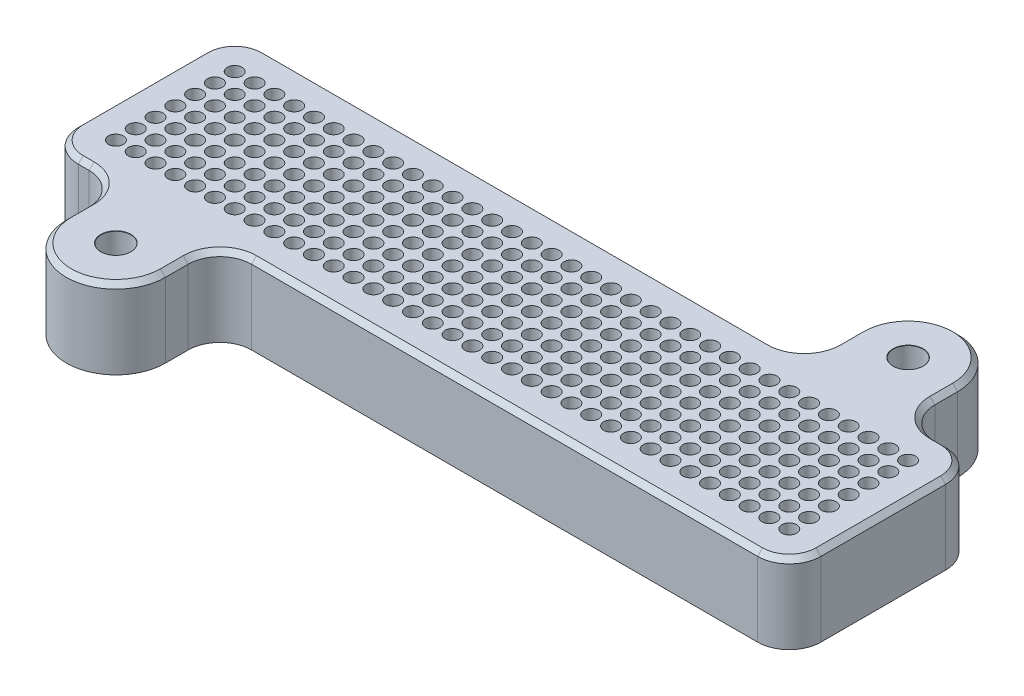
from build123d import *

# Parameters (mm, degrees)
SKETCH2_R                       = 0.75
BOSS_EXTRUDE1_DEPTH             = 8
FILLET7_R                       = 3.2004
F_3_0MM_DOWEL_HOLE1_D           = 3
F_3_0MM_DOWEL_HOLE1_DEPTH       = 10
F_3_0MM_DOWEL_HOLE1_CSINK_D     = 3.05
F_3_0MM_DOWEL_HOLE1_CSINK_ANGLE = 90
F_3_0MM_DOWEL_HOLE1_TIP         = 0.901290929
CHAMFER1_SIZE                   = 0.5


with BuildPart() as part:
    # Sketch2 → Boss-Extrude1 (new body)
    with BuildSketch(Plane(origin=(0, 0, 0), x_dir=(1, 0, 0), z_dir=(0, 1, 0))):
        with BuildLine():
            Line((-37.500004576, 9.5), (20, 9.5))
            Line((20, 9.5), (20, 15))
            ThreePointArc((20, 15), (25, 20), (30, 15))
            Line((30, 15), (30, 9.5))
            Line((30, 9.5), (37.500004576, 9.5))
            Line((37.500004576, 9.5), (37.500004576, -9.5))
            Line((37.500004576, -9.5), (-20, -9.5))
            Line((-20, -9.5), (-20, -15))
            ThreePointArc((-20, -15), (-25, -20), (-30, -15))
            Line((-30, -15), (-30, -9.5))
            Line((-30, -9.5), (-37.500004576, -9.5))
            Line((-37.500004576, -9.5), (-37.500004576, 9.5))
        make_face()
        with Locations(Location((0, 0, 0), (0, 0, 270))):
            Circle(SKETCH2_R, mode=Mode.SUBTRACT)
        with Locations(Location((2, 0, 0), (0, 0, 270))):
            Circle(SKETCH2_R, mode=Mode.SUBTRACT)
        with Locations(Location((4, 0, 0), (0, 0, 270))):
            Circle(SKETCH2_R, mode=Mode.SUBTRACT)
        with Locations(Location((6, 0, 0), (0, 0, 270))):
            Circle(SKETCH2_R, mode=Mode.SUBTRACT)
        with Locations(Location((8, 0, 0), (0, 0, 270))):
            Circle(SKETCH2_R, mode=Mode.SUBTRACT)
        with Locations(Location((10, 0, 0), (0, 0, 270))):
            Circle(SKETCH2_R, mode=Mode.SUBTRACT)
        with Locations(Location((12, 0, 0), (0, 0, 270))):
            Circle(SKETCH2_R, mode=Mode.SUBTRACT)
        with Locations(Location((14, 0, 0), (0, 0, 270))):
            Circle(SKETCH2_R, mode=Mode.SUBTRACT)
        with Locations(Location((16, 0, 0), (0, 0, 270))):
            Circle(SKETCH2_R, mode=Mode.SUBTRACT)
        with Locations(Location((18, 0, 0), (0, 0, 270))):
            Circle(SKETCH2_R, mode=Mode.SUBTRACT)
        with Locations(Location((20, 0, 0), (0, 0, 270))):
            Circle(SKETCH2_R, mode=Mode.SUBTRACT)
        with Locations(Location((22, 0, 0), (0, 0, 270))):
            Circle(SKETCH2_R, mode=Mode.SUBTRACT)
        with Locations(Location((24, 0, 0), (0, 0, 270))):
            Circle(SKETCH2_R, mode=Mode.SUBTRACT)
        with Locations(Location((26, 0, 0), (0, 0, 270))):
            Circle(SKETCH2_R, mode=Mode.SUBTRACT)
        with Locations(Location((28, 0, 0), (0, 0, 270))):
            Circle(SKETCH2_R, mode=Mode.SUBTRACT)
        with Locations(Location((30, 0, 0), (0, 0, 270))):
            Circle(SKETCH2_R, mode=Mode.SUBTRACT)
        with Locations(Location((32, 0, 0), (0, 0, 270))):
            Circle(SKETCH2_R, mode=Mode.SUBTRACT)
        with Locations(Location((34, 0, 0), (0, 0, 270))):
            Circle(SKETCH2_R, mode=Mode.SUBTRACT)
        with Locations(Location((2, 2, 0), (0, 0, 270))):
            Circle(SKETCH2_R, mode=Mode.SUBTRACT)
        with Locations(Location((4, 2, 0), (0, 0, 270))):
            Circle(SKETCH2_R, mode=Mode.SUBTRACT)
        with Locations(Location((6, 2, 0), (0, 0, 270))):
            Circle(SKETCH2_R, mode=Mode.SUBTRACT)
        with Locations(Location((8, 2, 0), (0, 0, 270))):
            Circle(SKETCH2_R, mode=Mode.SUBTRACT)
        with Locations(Location((10, 2, 0), (0, 0, 270))):
            Circle(SKETCH2_R, mode=Mode.SUBTRACT)
        with Locations(Location((12, 2, 0), (0, 0, 270))):
            Circle(SKETCH2_R, mode=Mode.SUBTRACT)
        with Locations(Location((14, 2, 0), (0, 0, 270))):
            Circle(SKETCH2_R, mode=Mode.SUBTRACT)
        with Locations(Location((16, 2, 0), (0, 0, 270))):
            Circle(SKETCH2_R, mode=Mode.SUBTRACT)
        with Locations(Location((18, 2, 0), (0, 0, 270))):
            Circle(SKETCH2_R, mode=Mode.SUBTRACT)
        with Locations(Location((20, 2, 0), (0, 0, 270))):
            Circle(SKETCH2_R, mode=Mode.SUBTRACT)
        with Locations(Location((22, 2, 0), (0, 0, 270))):
            Circle(SKETCH2_R, mode=Mode.SUBTRACT)
        with Locations(Location((24, 2, 0), (0, 0, 270))):
            Circle(SKETCH2_R, mode=Mode.SUBTRACT)
        with Locations(Location((26, 2, 0), (0, 0, 270))):
            Circle(SKETCH2_R, mode=Mode.SUBTRACT)
        with Locations(Location((28, 2, 0), (0, 0, 270))):
            Circle(SKETCH2_R, mode=Mode.SUBTRACT)
        with Locations(Location((30, 2, 0), (0, 0, 270))):
            Circle(SKETCH2_R, mode=Mode.SUBTRACT)
        with Locations(Location((32, 2, 0), (0, 0, 270))):
            Circle(SKETCH2_R, mode=Mode.SUBTRACT)
        with Locations(Location((34, 2, 0), (0, 0, 270))):
            Circle(SKETCH2_R, mode=Mode.SUBTRACT)
        with Locations(Location((2, 4, 0), (0, 0, 270))):
            Circle(SKETCH2_R, mode=Mode.SUBTRACT)
        with Locations(Location((4, 4, 0), (0, 0, 270))):
            Circle(SKETCH2_R, mode=Mode.SUBTRACT)
        with Locations(Location((6, 4, 0), (0, 0, 270))):
            Circle(SKETCH2_R, mode=Mode.SUBTRACT)
        with Locations(Location((8, 4, 0), (0, 0, 270))):
            Circle(SKETCH2_R, mode=Mode.SUBTRACT)
        with Locations(Location((10, 4, 0), (0, 0, 270))):
            Circle(SKETCH2_R, mode=Mode.SUBTRACT)
        with Locations(Location((12, 4, 0), (0, 0, 270))):
            Circle(SKETCH2_R, mode=Mode.SUBTRACT)
        with Locations(Location((14, 4, 0), (0, 0, 270))):
            Circle(SKETCH2_R, mode=Mode.SUBTRACT)
        with Locations(Location((16, 4, 0), (0, 0, 270))):
            Circle(SKETCH2_R, mode=Mode.SUBTRACT)
        with Locations(Location((18, 4, 0), (0, 0, 270))):
            Circle(SKETCH2_R, mode=Mode.SUBTRACT)
        with Locations(Location((20, 4, 0), (0, 0, 270))):
            Circle(SKETCH2_R, mode=Mode.SUBTRACT)
        with Locations(Location((22, 4, 0), (0, 0, 270))):
            Circle(SKETCH2_R, mode=Mode.SUBTRACT)
        with Locations(Location((24, 4, 0), (0, 0, 270))):
            Circle(SKETCH2_R, mode=Mode.SUBTRACT)
        with Locations(Location((26, 4, 0), (0, 0, 270))):
            Circle(SKETCH2_R, mode=Mode.SUBTRACT)
        with Locations(Location((28, 4, 0), (0, 0, 270))):
            Circle(SKETCH2_R, mode=Mode.SUBTRACT)
        with Locations(Location((30, 4, 0), (0, 0, 270))):
            Circle(SKETCH2_R, mode=Mode.SUBTRACT)
        with Locations(Location((32, 4, 0), (0, 0, 270))):
            Circle(SKETCH2_R, mode=Mode.SUBTRACT)
        with Locations(Location((34, 4, 0), (0, 0, 270))):
            Circle(SKETCH2_R, mode=Mode.SUBTRACT)
        with Locations(Location((2, 6, 0), (0, 0, 270))):
            Circle(SKETCH2_R, mode=Mode.SUBTRACT)
        with Locations(Location((4, 6, 0), (0, 0, 270))):
            Circle(SKETCH2_R, mode=Mode.SUBTRACT)
        with Locations(Location((6, 6, 0), (0, 0, 270))):
            Circle(SKETCH2_R, mode=Mode.SUBTRACT)
        with Locations(Location((8, 6, 0), (0, 0, 270))):
            Circle(SKETCH2_R, mode=Mode.SUBTRACT)
        with Locations(Location((10, 6, 0), (0, 0, 270))):
            Circle(SKETCH2_R, mode=Mode.SUBTRACT)
        with Locations(Location((12, 6, 0), (0, 0, 270))):
            Circle(SKETCH2_R, mode=Mode.SUBTRACT)
        with Locations(Location((14, 6, 0), (0, 0, 270))):
            Circle(SKETCH2_R, mode=Mode.SUBTRACT)
        with Locations(Location((16, 6, 0), (0, 0, 270))):
            Circle(SKETCH2_R, mode=Mode.SUBTRACT)
        with Locations(Location((18, 6, 0), (0, 0, 270))):
            Circle(SKETCH2_R, mode=Mode.SUBTRACT)
        with Locations(Location((20, 6, 0), (0, 0, 270))):
            Circle(SKETCH2_R, mode=Mode.SUBTRACT)
        with Locations(Location((22, 6, 0), (0, 0, 270))):
            Circle(SKETCH2_R, mode=Mode.SUBTRACT)
        with Locations(Location((24, 6, 0), (0, 0, 270))):
            Circle(SKETCH2_R, mode=Mode.SUBTRACT)
        with Locations(Location((26, 6, 0), (0, 0, 270))):
            Circle(SKETCH2_R, mode=Mode.SUBTRACT)
        with Locations(Location((28, 6, 0), (0, 0, 270))):
            Circle(SKETCH2_R, mode=Mode.SUBTRACT)
        with Locations(Location((30, 6, 0), (0, 0, 270))):
            Circle(SKETCH2_R, mode=Mode.SUBTRACT)
        with Locations(Location((32, 6, 0), (0, 0, 270))):
            Circle(SKETCH2_R, mode=Mode.SUBTRACT)
        with Locations(Location((34, 6, 0), (0, 0, 270))):
            Circle(SKETCH2_R, mode=Mode.SUBTRACT)
        with Locations(Location((0, 2, 0), (0, 0, 270))):
            Circle(SKETCH2_R, mode=Mode.SUBTRACT)
        with Locations(Location((0, 4, 0), (0, 0, 270))):
            Circle(SKETCH2_R, mode=Mode.SUBTRACT)
        with Locations(Location((0, 6, 0), (0, 0, 270))):
            Circle(SKETCH2_R, mode=Mode.SUBTRACT)
        with Locations(Location((-2, 0, 0), (0, 0, 270))):
            Circle(SKETCH2_R, mode=Mode.SUBTRACT)
        with Locations(Location((-2, 2, 0), (0, 0, 270))):
            Circle(SKETCH2_R, mode=Mode.SUBTRACT)
        with Locations(Location((-2, 4, 0), (0, 0, 270))):
            Circle(SKETCH2_R, mode=Mode.SUBTRACT)
        with Locations(Location((-2, 6, 0), (0, 0, 270))):
            Circle(SKETCH2_R, mode=Mode.SUBTRACT)
        with Locations(Location((-4, 0, 0), (0, 0, 270))):
            Circle(SKETCH2_R, mode=Mode.SUBTRACT)
        with Locations(Location((-4, 2, 0), (0, 0, 270))):
            Circle(SKETCH2_R, mode=Mode.SUBTRACT)
        with Locations(Location((-4, 4, 0), (0, 0, 270))):
            Circle(SKETCH2_R, mode=Mode.SUBTRACT)
        with Locations(Location((-4, 6, 0), (0, 0, 270))):
            Circle(SKETCH2_R, mode=Mode.SUBTRACT)
        with Locations(Location((-6, 0, 0), (0, 0, 270))):
            Circle(SKETCH2_R, mode=Mode.SUBTRACT)
        with Locations(Location((-6, 2, 0), (0, 0, 270))):
            Circle(SKETCH2_R, mode=Mode.SUBTRACT)
        with Locations(Location((-6, 4, 0), (0, 0, 270))):
            Circle(SKETCH2_R, mode=Mode.SUBTRACT)
        with Locations(Location((-6, 6, 0), (0, 0, 270))):
            Circle(SKETCH2_R, mode=Mode.SUBTRACT)
        with Locations(Location((-8, 0, 0), (0, 0, 270))):
            Circle(SKETCH2_R, mode=Mode.SUBTRACT)
        with Locations(Location((-8, 2, 0), (0, 0, 270))):
            Circle(SKETCH2_R, mode=Mode.SUBTRACT)
        with Locations(Location((-8, 4, 0), (0, 0, 270))):
            Circle(SKETCH2_R, mode=Mode.SUBTRACT)
        with Locations(Location((-8, 6, 0), (0, 0, 270))):
            Circle(SKETCH2_R, mode=Mode.SUBTRACT)
        with Locations(Location((-10, 0, 0), (0, 0, 270))):
            Circle(SKETCH2_R, mode=Mode.SUBTRACT)
        with Locations(Location((-10, 2, 0), (0, 0, 270))):
            Circle(SKETCH2_R, mode=Mode.SUBTRACT)
        with Locations(Location((-10, 4, 0), (0, 0, 270))):
            Circle(SKETCH2_R, mode=Mode.SUBTRACT)
        with Locations(Location((-10, 6, 0), (0, 0, 270))):
            Circle(SKETCH2_R, mode=Mode.SUBTRACT)
        with Locations(Location((-12, 0, 0), (0, 0, 270))):
            Circle(SKETCH2_R, mode=Mode.SUBTRACT)
        with Locations(Location((-12, 2, 0), (0, 0, 270))):
            Circle(SKETCH2_R, mode=Mode.SUBTRACT)
        with Locations(Location((-12, 4, 0), (0, 0, 270))):
            Circle(SKETCH2_R, mode=Mode.SUBTRACT)
        with Locations(Location((-12, 6, 0), (0, 0, 270))):
            Circle(SKETCH2_R, mode=Mode.SUBTRACT)
        with Locations(Location((-14, 0, 0), (0, 0, 270))):
            Circle(SKETCH2_R, mode=Mode.SUBTRACT)
        with Locations(Location((-14, 2, 0), (0, 0, 270))):
            Circle(SKETCH2_R, mode=Mode.SUBTRACT)
        with Locations(Location((-14, 4, 0), (0, 0, 270))):
            Circle(SKETCH2_R, mode=Mode.SUBTRACT)
        with Locations(Location((-14, 6, 0), (0, 0, 270))):
            Circle(SKETCH2_R, mode=Mode.SUBTRACT)
        with Locations(Location((-16, 0, 0), (0, 0, 270))):
            Circle(SKETCH2_R, mode=Mode.SUBTRACT)
        with Locations(Location((-16, 2, 0), (0, 0, 270))):
            Circle(SKETCH2_R, mode=Mode.SUBTRACT)
        with Locations(Location((-16, 4, 0), (0, 0, 270))):
            Circle(SKETCH2_R, mode=Mode.SUBTRACT)
        with Locations(Location((-16, 6, 0), (0, 0, 270))):
            Circle(SKETCH2_R, mode=Mode.SUBTRACT)
        with Locations(Location((-18, 0, 0), (0, 0, 270))):
            Circle(SKETCH2_R, mode=Mode.SUBTRACT)
        with Locations(Location((-18, 2, 0), (0, 0, 270))):
            Circle(SKETCH2_R, mode=Mode.SUBTRACT)
        with Locations(Location((-18, 4, 0), (0, 0, 270))):
            Circle(SKETCH2_R, mode=Mode.SUBTRACT)
        with Locations(Location((-18, 6, 0), (0, 0, 270))):
            Circle(SKETCH2_R, mode=Mode.SUBTRACT)
        with Locations(Location((-20, 0, 0), (0, 0, 270))):
            Circle(SKETCH2_R, mode=Mode.SUBTRACT)
        with Locations(Location((-20, 2, 0), (0, 0, 270))):
            Circle(SKETCH2_R, mode=Mode.SUBTRACT)
        with Locations(Location((-20, 4, 0), (0, 0, 270))):
            Circle(SKETCH2_R, mode=Mode.SUBTRACT)
        with Locations(Location((-20, 6, 0), (0, 0, 270))):
            Circle(SKETCH2_R, mode=Mode.SUBTRACT)
        with Locations(Location((-22, 0, 0), (0, 0, 270))):
            Circle(SKETCH2_R, mode=Mode.SUBTRACT)
        with Locations(Location((-22, 2, 0), (0, 0, 270))):
            Circle(SKETCH2_R, mode=Mode.SUBTRACT)
        with Locations(Location((-22, 4, 0), (0, 0, 270))):
            Circle(SKETCH2_R, mode=Mode.SUBTRACT)
        with Locations(Location((-22, 6, 0), (0, 0, 270))):
            Circle(SKETCH2_R, mode=Mode.SUBTRACT)
        with Locations(Location((-24, 0, 0), (0, 0, 270))):
            Circle(SKETCH2_R, mode=Mode.SUBTRACT)
        with Locations(Location((-24, 2, 0), (0, 0, 270))):
            Circle(SKETCH2_R, mode=Mode.SUBTRACT)
        with Locations(Location((-24, 4, 0), (0, 0, 270))):
            Circle(SKETCH2_R, mode=Mode.SUBTRACT)
        with Locations(Location((-24, 6, 0), (0, 0, 270))):
            Circle(SKETCH2_R, mode=Mode.SUBTRACT)
        with Locations(Location((-26, 0, 0), (0, 0, 270))):
            Circle(SKETCH2_R, mode=Mode.SUBTRACT)
        with Locations(Location((-26, 2, 0), (0, 0, 270))):
            Circle(SKETCH2_R, mode=Mode.SUBTRACT)
        with Locations(Location((-26, 4, 0), (0, 0, 270))):
            Circle(SKETCH2_R, mode=Mode.SUBTRACT)
        with Locations(Location((-26, 6, 0), (0, 0, 270))):
            Circle(SKETCH2_R, mode=Mode.SUBTRACT)
        with Locations(Location((-28, 0, 0), (0, 0, 270))):
            Circle(SKETCH2_R, mode=Mode.SUBTRACT)
        with Locations(Location((-28, 2, 0), (0, 0, 270))):
            Circle(SKETCH2_R, mode=Mode.SUBTRACT)
        with Locations(Location((-28, 4, 0), (0, 0, 270))):
            Circle(SKETCH2_R, mode=Mode.SUBTRACT)
        with Locations(Location((-28, 6, 0), (0, 0, 270))):
            Circle(SKETCH2_R, mode=Mode.SUBTRACT)
        with Locations(Location((-30, 0, 0), (0, 0, 270))):
            Circle(SKETCH2_R, mode=Mode.SUBTRACT)
        with Locations(Location((-30, 2, 0), (0, 0, 270))):
            Circle(SKETCH2_R, mode=Mode.SUBTRACT)
        with Locations(Location((-30, 4, 0), (0, 0, 270))):
            Circle(SKETCH2_R, mode=Mode.SUBTRACT)
        with Locations(Location((-30, 6, 0), (0, 0, 270))):
            Circle(SKETCH2_R, mode=Mode.SUBTRACT)
        with Locations(Location((-32, 0, 0), (0, 0, 270))):
            Circle(SKETCH2_R, mode=Mode.SUBTRACT)
        with Locations(Location((-32, 2, 0), (0, 0, 270))):
            Circle(SKETCH2_R, mode=Mode.SUBTRACT)
        with Locations(Location((-32, 4, 0), (0, 0, 270))):
            Circle(SKETCH2_R, mode=Mode.SUBTRACT)
        with Locations(Location((-32, 6, 0), (0, 0, 270))):
            Circle(SKETCH2_R, mode=Mode.SUBTRACT)
        with Locations(Location((-34, 0, 0), (0, 0, 270))):
            Circle(SKETCH2_R, mode=Mode.SUBTRACT)
        with Locations(Location((-34, 2, 0), (0, 0, 270))):
            Circle(SKETCH2_R, mode=Mode.SUBTRACT)
        with Locations(Location((-34, 4, 0), (0, 0, 270))):
            Circle(SKETCH2_R, mode=Mode.SUBTRACT)
        with Locations(Location((-34, 6, 0), (0, 0, 270))):
            Circle(SKETCH2_R, mode=Mode.SUBTRACT)
        with Locations(Location((0, -2, 0), (0, 0, 270))):
            Circle(SKETCH2_R, mode=Mode.SUBTRACT)
        with Locations(Location((2, -2, 0), (0, 0, 270))):
            Circle(SKETCH2_R, mode=Mode.SUBTRACT)
        with Locations(Location((4, -2, 0), (0, 0, 270))):
            Circle(SKETCH2_R, mode=Mode.SUBTRACT)
        with Locations(Location((6, -2, 0), (0, 0, 270))):
            Circle(SKETCH2_R, mode=Mode.SUBTRACT)
        with Locations(Location((8, -2, 0), (0, 0, 270))):
            Circle(SKETCH2_R, mode=Mode.SUBTRACT)
        with Locations(Location((10, -2, 0), (0, 0, 270))):
            Circle(SKETCH2_R, mode=Mode.SUBTRACT)
        with Locations(Location((12, -2, 0), (0, 0, 270))):
            Circle(SKETCH2_R, mode=Mode.SUBTRACT)
        with Locations(Location((14, -2, 0), (0, 0, 270))):
            Circle(SKETCH2_R, mode=Mode.SUBTRACT)
        with Locations(Location((16, -2, 0), (0, 0, 270))):
            Circle(SKETCH2_R, mode=Mode.SUBTRACT)
        with Locations(Location((18, -2, 0), (0, 0, 270))):
            Circle(SKETCH2_R, mode=Mode.SUBTRACT)
        with Locations(Location((20, -2, 0), (0, 0, 270))):
            Circle(SKETCH2_R, mode=Mode.SUBTRACT)
        with Locations(Location((22, -2, 0), (0, 0, 270))):
            Circle(SKETCH2_R, mode=Mode.SUBTRACT)
        with Locations(Location((24, -2, 0), (0, 0, 270))):
            Circle(SKETCH2_R, mode=Mode.SUBTRACT)
        with Locations(Location((26, -2, 0), (0, 0, 270))):
            Circle(SKETCH2_R, mode=Mode.SUBTRACT)
        with Locations(Location((28, -2, 0), (0, 0, 270))):
            Circle(SKETCH2_R, mode=Mode.SUBTRACT)
        with Locations(Location((30, -2, 0), (0, 0, 270))):
            Circle(SKETCH2_R, mode=Mode.SUBTRACT)
        with Locations(Location((32, -2, 0), (0, 0, 270))):
            Circle(SKETCH2_R, mode=Mode.SUBTRACT)
        with Locations(Location((34, -2, 0), (0, 0, 270))):
            Circle(SKETCH2_R, mode=Mode.SUBTRACT)
        with Locations(Location((-2, -2, 0), (0, 0, 270))):
            Circle(SKETCH2_R, mode=Mode.SUBTRACT)
        with Locations(Location((-4, -2, 0), (0, 0, 270))):
            Circle(SKETCH2_R, mode=Mode.SUBTRACT)
        with Locations(Location((-6, -2, 0), (0, 0, 270))):
            Circle(SKETCH2_R, mode=Mode.SUBTRACT)
        with Locations(Location((-8, -2, 0), (0, 0, 270))):
            Circle(SKETCH2_R, mode=Mode.SUBTRACT)
        with Locations(Location((-10, -2, 0), (0, 0, 270))):
            Circle(SKETCH2_R, mode=Mode.SUBTRACT)
        with Locations(Location((-12, -2, 0), (0, 0, 270))):
            Circle(SKETCH2_R, mode=Mode.SUBTRACT)
        with Locations(Location((-14, -2, 0), (0, 0, 270))):
            Circle(SKETCH2_R, mode=Mode.SUBTRACT)
        with Locations(Location((-16, -2, 0), (0, 0, 270))):
            Circle(SKETCH2_R, mode=Mode.SUBTRACT)
        with Locations(Location((-18, -2, 0), (0, 0, 270))):
            Circle(SKETCH2_R, mode=Mode.SUBTRACT)
        with Locations(Location((-20, -2, 0), (0, 0, 270))):
            Circle(SKETCH2_R, mode=Mode.SUBTRACT)
        with Locations(Location((-22, -2, 0), (0, 0, 270))):
            Circle(SKETCH2_R, mode=Mode.SUBTRACT)
        with Locations(Location((-24, -2, 0), (0, 0, 270))):
            Circle(SKETCH2_R, mode=Mode.SUBTRACT)
        with Locations(Location((-26, -2, 0), (0, 0, 270))):
            Circle(SKETCH2_R, mode=Mode.SUBTRACT)
        with Locations(Location((-28, -2, 0), (0, 0, 270))):
            Circle(SKETCH2_R, mode=Mode.SUBTRACT)
        with Locations(Location((-30, -2, 0), (0, 0, 270))):
            Circle(SKETCH2_R, mode=Mode.SUBTRACT)
        with Locations(Location((-32, -2, 0), (0, 0, 270))):
            Circle(SKETCH2_R, mode=Mode.SUBTRACT)
        with Locations(Location((-34, -2, 0), (0, 0, 270))):
            Circle(SKETCH2_R, mode=Mode.SUBTRACT)
        with Locations(Location((0, -4, 0), (0, 0, 270))):
            Circle(SKETCH2_R, mode=Mode.SUBTRACT)
        with Locations(Location((2, -4, 0), (0, 0, 270))):
            Circle(SKETCH2_R, mode=Mode.SUBTRACT)
        with Locations(Location((4, -4, 0), (0, 0, 270))):
            Circle(SKETCH2_R, mode=Mode.SUBTRACT)
        with Locations(Location((6, -4, 0), (0, 0, 270))):
            Circle(SKETCH2_R, mode=Mode.SUBTRACT)
        with Locations(Location((8, -4, 0), (0, 0, 270))):
            Circle(SKETCH2_R, mode=Mode.SUBTRACT)
        with Locations(Location((10, -4, 0), (0, 0, 270))):
            Circle(SKETCH2_R, mode=Mode.SUBTRACT)
        with Locations(Location((12, -4, 0), (0, 0, 270))):
            Circle(SKETCH2_R, mode=Mode.SUBTRACT)
        with Locations(Location((14, -4, 0), (0, 0, 270))):
            Circle(SKETCH2_R, mode=Mode.SUBTRACT)
        with Locations(Location((16, -4, 0), (0, 0, 270))):
            Circle(SKETCH2_R, mode=Mode.SUBTRACT)
        with Locations(Location((18, -4, 0), (0, 0, 270))):
            Circle(SKETCH2_R, mode=Mode.SUBTRACT)
        with Locations(Location((20, -4, 0), (0, 0, 270))):
            Circle(SKETCH2_R, mode=Mode.SUBTRACT)
        with Locations(Location((22, -4, 0), (0, 0, 270))):
            Circle(SKETCH2_R, mode=Mode.SUBTRACT)
        with Locations(Location((24, -4, 0), (0, 0, 270))):
            Circle(SKETCH2_R, mode=Mode.SUBTRACT)
        with Locations(Location((26, -4, 0), (0, 0, 270))):
            Circle(SKETCH2_R, mode=Mode.SUBTRACT)
        with Locations(Location((28, -4, 0), (0, 0, 270))):
            Circle(SKETCH2_R, mode=Mode.SUBTRACT)
        with Locations(Location((30, -4, 0), (0, 0, 270))):
            Circle(SKETCH2_R, mode=Mode.SUBTRACT)
        with Locations(Location((32, -4, 0), (0, 0, 270))):
            Circle(SKETCH2_R, mode=Mode.SUBTRACT)
        with Locations(Location((34, -4, 0), (0, 0, 270))):
            Circle(SKETCH2_R, mode=Mode.SUBTRACT)
        with Locations(Location((-2, -4, 0), (0, 0, 270))):
            Circle(SKETCH2_R, mode=Mode.SUBTRACT)
        with Locations(Location((-4, -4, 0), (0, 0, 270))):
            Circle(SKETCH2_R, mode=Mode.SUBTRACT)
        with Locations(Location((-6, -4, 0), (0, 0, 270))):
            Circle(SKETCH2_R, mode=Mode.SUBTRACT)
        with Locations(Location((-8, -4, 0), (0, 0, 270))):
            Circle(SKETCH2_R, mode=Mode.SUBTRACT)
        with Locations(Location((-10, -4, 0), (0, 0, 270))):
            Circle(SKETCH2_R, mode=Mode.SUBTRACT)
        with Locations(Location((-12, -4, 0), (0, 0, 270))):
            Circle(SKETCH2_R, mode=Mode.SUBTRACT)
        with Locations(Location((-14, -4, 0), (0, 0, 270))):
            Circle(SKETCH2_R, mode=Mode.SUBTRACT)
        with Locations(Location((-16, -4, 0), (0, 0, 270))):
            Circle(SKETCH2_R, mode=Mode.SUBTRACT)
        with Locations(Location((-18, -4, 0), (0, 0, 270))):
            Circle(SKETCH2_R, mode=Mode.SUBTRACT)
        with Locations(Location((-20, -4, 0), (0, 0, 270))):
            Circle(SKETCH2_R, mode=Mode.SUBTRACT)
        with Locations(Location((-22, -4, 0), (0, 0, 270))):
            Circle(SKETCH2_R, mode=Mode.SUBTRACT)
        with Locations(Location((-24, -4, 0), (0, 0, 270))):
            Circle(SKETCH2_R, mode=Mode.SUBTRACT)
        with Locations(Location((-26, -4, 0), (0, 0, 270))):
            Circle(SKETCH2_R, mode=Mode.SUBTRACT)
        with Locations(Location((-28, -4, 0), (0, 0, 270))):
            Circle(SKETCH2_R, mode=Mode.SUBTRACT)
        with Locations(Location((-30, -4, 0), (0, 0, 270))):
            Circle(SKETCH2_R, mode=Mode.SUBTRACT)
        with Locations(Location((-32, -4, 0), (0, 0, 270))):
            Circle(SKETCH2_R, mode=Mode.SUBTRACT)
        with Locations(Location((-34, -4, 0), (0, 0, 270))):
            Circle(SKETCH2_R, mode=Mode.SUBTRACT)
        with Locations(Location((0, -6, 0), (0, 0, 270))):
            Circle(SKETCH2_R, mode=Mode.SUBTRACT)
        with Locations(Location((2, -6, 0), (0, 0, 270))):
            Circle(SKETCH2_R, mode=Mode.SUBTRACT)
        with Locations(Location((4, -6, 0), (0, 0, 270))):
            Circle(SKETCH2_R, mode=Mode.SUBTRACT)
        with Locations(Location((6, -6, 0), (0, 0, 270))):
            Circle(SKETCH2_R, mode=Mode.SUBTRACT)
        with Locations(Location((8, -6, 0), (0, 0, 270))):
            Circle(SKETCH2_R, mode=Mode.SUBTRACT)
        with Locations(Location((10, -6, 0), (0, 0, 270))):
            Circle(SKETCH2_R, mode=Mode.SUBTRACT)
        with Locations(Location((12, -6, 0), (0, 0, 270))):
            Circle(SKETCH2_R, mode=Mode.SUBTRACT)
        with Locations(Location((14, -6, 0), (0, 0, 270))):
            Circle(SKETCH2_R, mode=Mode.SUBTRACT)
        with Locations(Location((16, -6, 0), (0, 0, 270))):
            Circle(SKETCH2_R, mode=Mode.SUBTRACT)
        with Locations(Location((18, -6, 0), (0, 0, 270))):
            Circle(SKETCH2_R, mode=Mode.SUBTRACT)
        with Locations(Location((20, -6, 0), (0, 0, 270))):
            Circle(SKETCH2_R, mode=Mode.SUBTRACT)
        with Locations(Location((22, -6, 0), (0, 0, 270))):
            Circle(SKETCH2_R, mode=Mode.SUBTRACT)
        with Locations(Location((24, -6, 0), (0, 0, 270))):
            Circle(SKETCH2_R, mode=Mode.SUBTRACT)
        with Locations(Location((26, -6, 0), (0, 0, 270))):
            Circle(SKETCH2_R, mode=Mode.SUBTRACT)
        with Locations(Location((28, -6, 0), (0, 0, 270))):
            Circle(SKETCH2_R, mode=Mode.SUBTRACT)
        with Locations(Location((30, -6, 0), (0, 0, 270))):
            Circle(SKETCH2_R, mode=Mode.SUBTRACT)
        with Locations(Location((32, -6, 0), (0, 0, 270))):
            Circle(SKETCH2_R, mode=Mode.SUBTRACT)
        with Locations(Location((34, -6, 0), (0, 0, 270))):
            Circle(SKETCH2_R, mode=Mode.SUBTRACT)
        with Locations(Location((-2, -6, 0), (0, 0, 270))):
            Circle(SKETCH2_R, mode=Mode.SUBTRACT)
        with Locations(Location((-4, -6, 0), (0, 0, 270))):
            Circle(SKETCH2_R, mode=Mode.SUBTRACT)
        with Locations(Location((-6, -6, 0), (0, 0, 270))):
            Circle(SKETCH2_R, mode=Mode.SUBTRACT)
        with Locations(Location((-8, -6, 0), (0, 0, 270))):
            Circle(SKETCH2_R, mode=Mode.SUBTRACT)
        with Locations(Location((-10, -6, 0), (0, 0, 270))):
            Circle(SKETCH2_R, mode=Mode.SUBTRACT)
        with Locations(Location((-12, -6, 0), (0, 0, 270))):
            Circle(SKETCH2_R, mode=Mode.SUBTRACT)
        with Locations(Location((-14, -6, 0), (0, 0, 270))):
            Circle(SKETCH2_R, mode=Mode.SUBTRACT)
        with Locations(Location((-16, -6, 0), (0, 0, 270))):
            Circle(SKETCH2_R, mode=Mode.SUBTRACT)
        with Locations(Location((-18, -6, 0), (0, 0, 270))):
            Circle(SKETCH2_R, mode=Mode.SUBTRACT)
        with Locations(Location((-20, -6, 0), (0, 0, 270))):
            Circle(SKETCH2_R, mode=Mode.SUBTRACT)
        with Locations(Location((-22, -6, 0), (0, 0, 270))):
            Circle(SKETCH2_R, mode=Mode.SUBTRACT)
        with Locations(Location((-24, -6, 0), (0, 0, 270))):
            Circle(SKETCH2_R, mode=Mode.SUBTRACT)
        with Locations(Location((-26, -6, 0), (0, 0, 270))):
            Circle(SKETCH2_R, mode=Mode.SUBTRACT)
        with Locations(Location((-28, -6, 0), (0, 0, 270))):
            Circle(SKETCH2_R, mode=Mode.SUBTRACT)
        with Locations(Location((-30, -6, 0), (0, 0, 270))):
            Circle(SKETCH2_R, mode=Mode.SUBTRACT)
        with Locations(Location((-32, -6, 0), (0, 0, 270))):
            Circle(SKETCH2_R, mode=Mode.SUBTRACT)
        with Locations(Location((-34, -6, 0), (0, 0, 270))):
            Circle(SKETCH2_R, mode=Mode.SUBTRACT)
    extrude(amount=BOSS_EXTRUDE1_DEPTH)

    # Fillet7
    fillet7_edges = [part.edges().sort_by_distance(p)[0] for p in [
        (37.500004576, 4, -9.5),
        (37.500004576, 4, 9.5),
        (-20, 4, 9.5),
        (-30, 4, 9.5),
        (-37.500004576, 4, 9.5),
        (-37.500004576, 4, -9.5),
        (20, 4, -9.5),
        (30, 4, -9.5),
    ]]
    fillet(fillet7_edges, radius=FILLET7_R)

    # 3.0mm Dowel Hole1
    with Locations(Plane(origin=(0, 8, 0), x_dir=(1, 0, 0), z_dir=(0, 1, 0))):
        with Locations((-25, -15), (25, 15)):
            CounterSinkHole(F_3_0MM_DOWEL_HOLE1_D / 2, F_3_0MM_DOWEL_HOLE1_CSINK_D / 2, depth=F_3_0MM_DOWEL_HOLE1_DEPTH, counter_sink_angle=F_3_0MM_DOWEL_HOLE1_CSINK_ANGLE)
            with Locations((0, 0, -(F_3_0MM_DOWEL_HOLE1_DEPTH + F_3_0MM_DOWEL_HOLE1_TIP / 2))):  # 118° drill point
                Cone(0, F_3_0MM_DOWEL_HOLE1_D / 2, F_3_0MM_DOWEL_HOLE1_TIP, mode=Mode.SUBTRACT)

    # Chamfer1
    chamfer1_edges = [part.edges().sort_by_distance(p)[0] for p in [
        (37.500004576, 8, 0),
        (8.750002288, 8, 9.5),
        (33.750002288, 8, -9.5),
        (30, 8, -13.8502),
        (-8.750002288, 8, -9.5),
        (-37.500004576, 8, 0),
        (-33.750002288, 8, 9.5),
        (-30, 8, 13.8502),
        (36.562629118, 8, -8.562624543),
        (-36.562629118, 8, -8.562624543),
        (-36.562629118, 8, 8.562624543),
        (36.562629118, 8, 8.562624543),
        (-19.062624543, 8, 10.437375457),
        (-30.937375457, 8, 10.437375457),
        (19.062624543, 8, -10.437375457),
        (30.937375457, 8, -10.437375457),
        (25, 8, -20),
        (20, 8, -13.8502),
        (-25, 8, 20),
        (-20, 8, 13.8502),
    ]]
    chamfer(chamfer1_edges, length=CHAMFER1_SIZE)


solid = part.part
